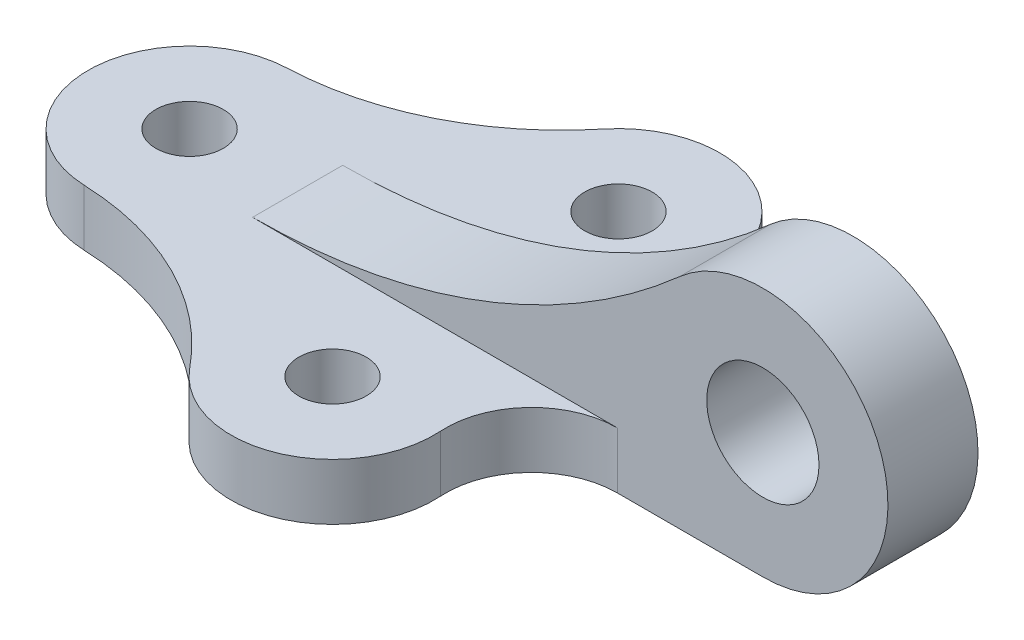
from build123d import *

# Parameters (mm, degrees)
SKETCH1_R      = 5.9944
EXTRUDE1_DEPTH = 10.0076
SKETCH2_R      = 9.9695
EXTRUDE2_DEPTH = 8.001


with BuildPart() as part:
    # Sketch1 → Extrude1 (new body)
    with BuildSketch(Plane(origin=(0, 0, 0), x_dir=(1, 0, 0), z_dir=(0, 1, 0))):
        with BuildLine():
            Line((84.003882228, 8.001), (84.003882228, -8.001))
            ThreePointArc((84.003882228, -8.001), (72.88345621, -12.82016869), (68.795997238, -24.229854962))
            ThreePointArc((68.795997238, -24.229854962), (57.378658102, -42.191260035), (36.798683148, -36.76610234))
            ThreePointArc((36.798683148, -36.76610234), (20.076804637, -23.346390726), (-0.69209176, -18.020714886))
            ThreePointArc((-0.69209176, -18.020714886), (-18.034, 0), (-0.69209176, 18.020714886))
            ThreePointArc((-0.69209176, 18.020714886), (20.076804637, 23.346390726), (36.798683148, 36.76610234))
            ThreePointArc((36.798683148, 36.76610234), (57.378658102, 42.191260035), (68.795997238, 24.229854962))
            ThreePointArc((68.795997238, 24.229854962), (72.88345621, 12.82016869), (84.003882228, 8.001))
        make_face()
        with Locations(Location((50.8, 25.4, 0), (0, 0, 270))):
            Circle(SKETCH1_R, mode=Mode.SUBTRACT)
        with Locations(Location((0, 0, 0), (0, 0, 270))):
            Circle(SKETCH1_R, mode=Mode.SUBTRACT)
        with Locations(Location((50.8, -25.4, 0), (0, 0, 270))):
            Circle(SKETCH1_R, mode=Mode.SUBTRACT)
    extrude(amount=EXTRUDE1_DEPTH)

    # Sketch2 → Extrude2 (add, symmetric)
    with BuildSketch(Plane.XY):
        with BuildLine():
            Line((109.855, 0), (19.200610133, 0))
            Line((19.200610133, 0), (19.200610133, 10.0076))
            ThreePointArc((19.200610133, 10.0076), (59.795544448, 17.459383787), (95.097308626, 38.843097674))
            ThreePointArc((95.097308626, 38.843097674), (130.631042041, 30.11845945), (109.855, 0))
        make_face()
        with Locations((109.855, 22.225)):
            Circle(SKETCH2_R, mode=Mode.SUBTRACT)
    extrude(amount=EXTRUDE2_DEPTH, both=True)


solid = part.part
